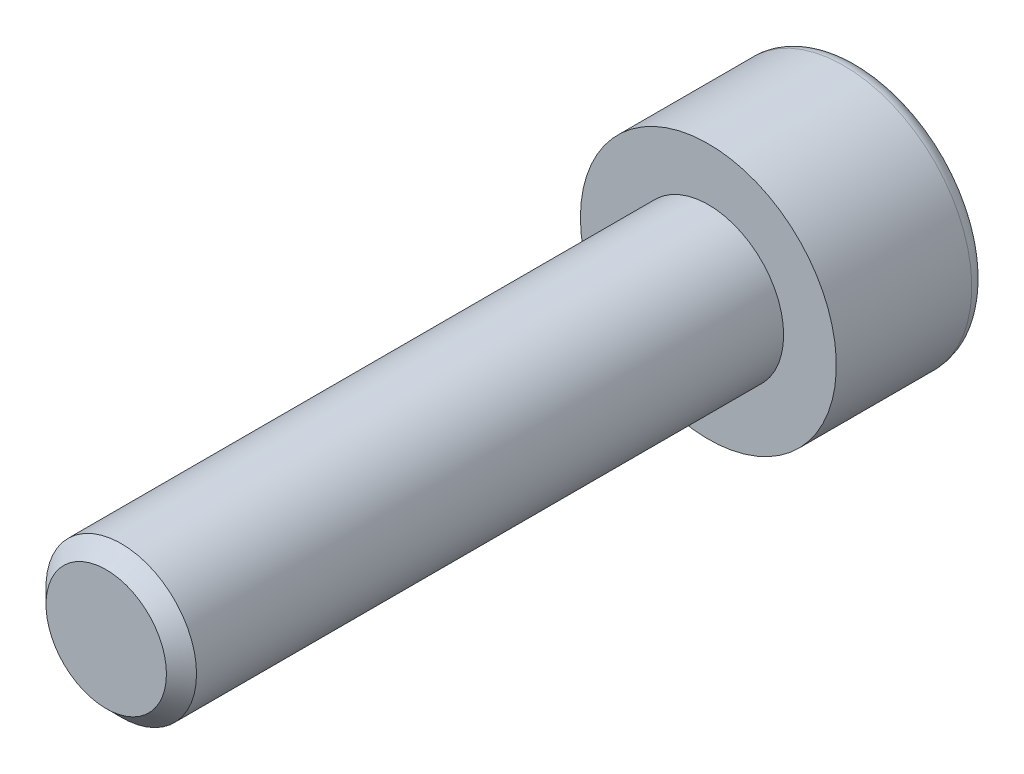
from build123d import *

# Parameters (mm, degrees)
ENLEV_MAT_EXTRU1_DEPTH = 2.5
ESQUISSE3_W            = 2.5
ESQUISSE3_H            = 20
CHANFREIN1_SIZE        = 0.5


with BuildPart() as part:
    # Esquisse1 → Base-R_volution (revolve)
    with BuildSketch(Plane(origin=(0, 0, 0), x_dir=(1, 0, 0), z_dir=(0, 1, 0)), mode=Mode.PRIVATE) as base_r_volution_sk:
        with BuildLine():
            Line((0, 0), (4.25, 0))
            Line((4.25, 0), (4.25, 4.5))
            ThreePointArc((4.25, 4.5), (4.103553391, 4.853553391), (3.75, 5))
            Line((3.75, 5), (0, 5))
            Line((0, 5), (0, 0))
        make_face()
    revolve(base_r_volution_sk.sketch.rotate(Axis((0, 0, 0), (0, 0, -1)), 180), axis=Axis((0, 0, 0), (0, 0, -1)))

    # Esquisse2 → enlev-mat-Extru1 (cut)
    with BuildSketch(Plane.XY.offset(-5)):
        Polygon((2, -1.154700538), (2, 1.154700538), (0, 2.309401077), (-2, 1.154700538), (-2, -1.154700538), (0, -2.309401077), align=None)
    extrude(amount=ENLEV_MAT_EXTRU1_DEPTH, mode=Mode.SUBTRACT)

    # Esquisse3 → Boss.-R_vol.1 (revolve)
    with BuildSketch(Plane(origin=(0, 0, 0), x_dir=(1, 0, 0), z_dir=(0, 1, 0))):
        with Locations((1.25, -10)):
            Rectangle(ESQUISSE3_W, ESQUISSE3_H)
    revolve(axis=Axis((0, 0, 0), (0, 0, 1)))

    # Chanfrein1
    chanfrein1_edges = [part.edges().sort_by_distance(p)[0] for p in [
        (-2.5, 0, 20),
    ]]
    chamfer(chanfrein1_edges, length=CHANFREIN1_SIZE)


solid = part.part
